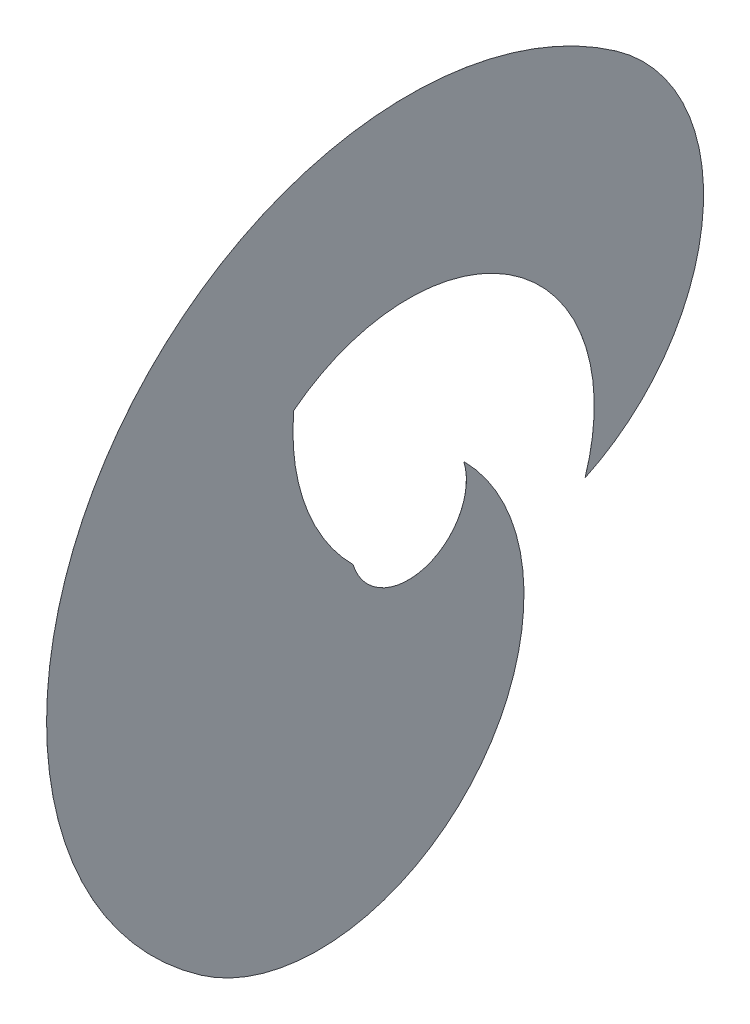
from build123d import *

# Parameters (mm, degrees)
EXTRUDE_1_DEPTH = 0.1


with BuildPart() as part:
    # Sketch 1 → Extrude 1 (new body)
    with BuildSketch(Plane(origin=(0, 0, 0), x_dir=(0, 0, -1), z_dir=(1, 0, 0))):
        with BuildLine():
            ThreePointArc((890.197745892, 2285.371138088), (-1878.371138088, 1797.197745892), (-1390.197745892, -971.371138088))
            ThreePointArc((-1390.197745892, -971.371138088), (120.725956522, -772.454259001), (54.251693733, 750.056670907))
            ThreePointArc((54.251693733, 750.056670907), (-156.943329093, 352.748306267), (-554.251693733, 563.943329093))
            ThreePointArc((-554.251693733, 563.943329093), (-816.579239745, 975.715094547), (-880.306469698, 1459.771463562))
            ThreePointArc((-880.306469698, 1459.771463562), (335.421308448, 1493.068274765), (719.935929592, 339.269672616))
            ThreePointArc((719.935929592, 339.269672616), (1366.857940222, 1263.170052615), (890.197745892, 2285.371138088))
        make_face()
    extrude(amount=EXTRUDE_1_DEPTH)


solid = part.part
